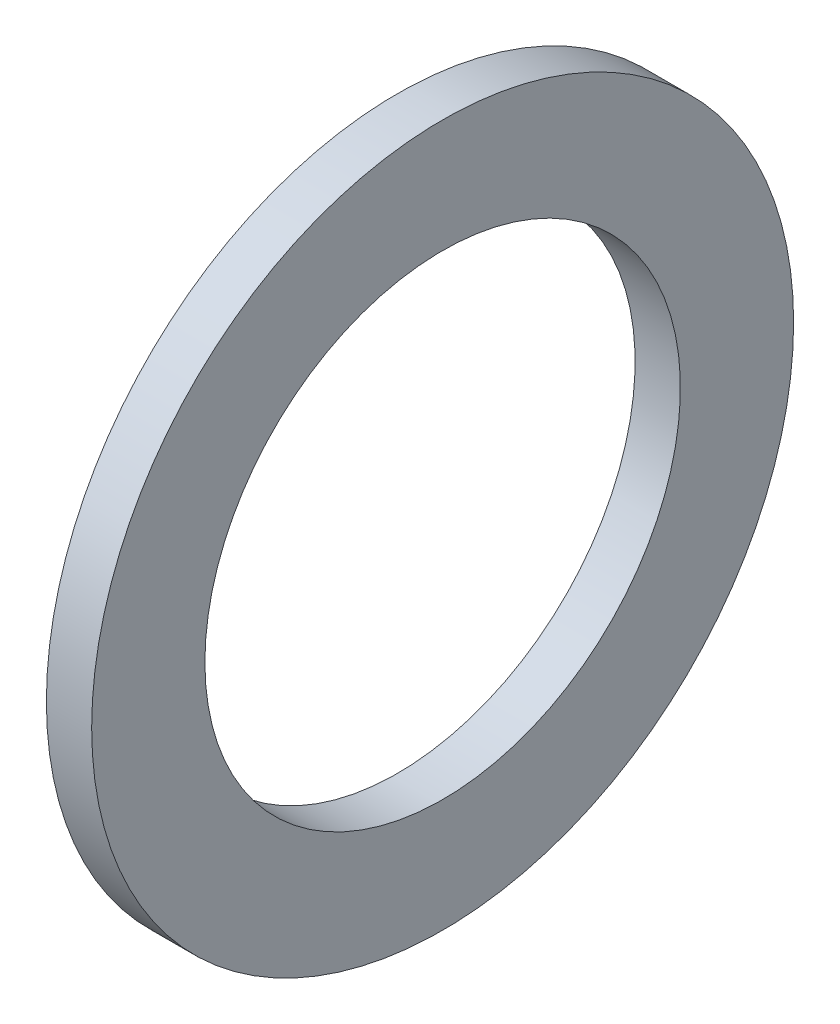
from build123d import *

# Parameters (mm, degrees)
SKETCH1_W = 2
SKETCH1_H = 5


with BuildPart() as part:
    # Sketch1 → Base-Revolve (revolve)
    with BuildSketch(Plane.XY, mode=Mode.PRIVATE) as base_revolve_sk:
        with Locations((-1, 13)):
            Rectangle(SKETCH1_W, SKETCH1_H)
    revolve(base_revolve_sk.sketch.rotate(Axis((-34.925, 0, 0), (1, 0, 0)), 90), axis=Axis((-34.925, 0, 0), (1, 0, 0)))


solid = part.part
